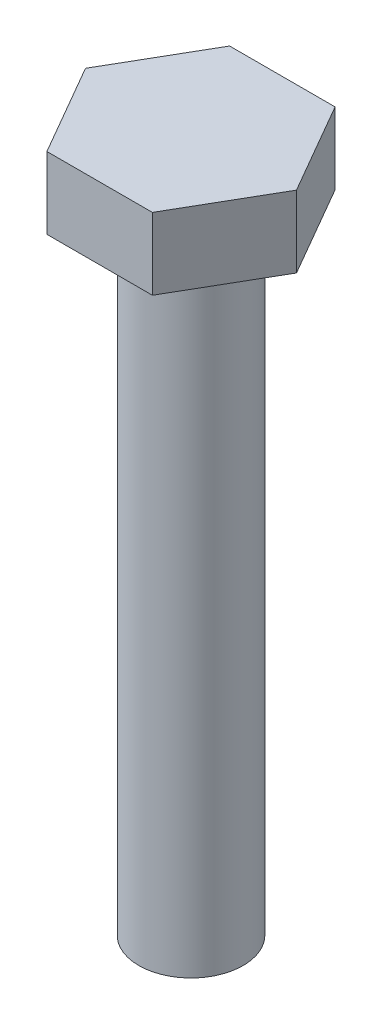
ISO-10303-21;
HEADER;
FILE_DESCRIPTION(('STEP AP214'),'2;1');
FILE_NAME('part.step','',(''),(''),'','','');
FILE_SCHEMA(('AUTOMOTIVE_DESIGN { 1 0 10303 214 1 1 1 1 }'));
ENDSEC;
DATA;
#1=APPLICATION_CONTEXT('core data for automotive mechanical design processes');
#2=APPLICATION_PROTOCOL_DEFINITION('international standard','automotive_design',2000,#1);
#3=PRODUCT_CONTEXT('',#1,'mechanical');
#4=PRODUCT('Part','Part','',(#3));
#5=PRODUCT_RELATED_PRODUCT_CATEGORY('part','',(#4));
#6=PRODUCT_DEFINITION_FORMATION('','',#4);
#7=PRODUCT_DEFINITION_CONTEXT('part definition',#1,'design');
#8=PRODUCT_DEFINITION('design','',#6,#7);
#9=PRODUCT_DEFINITION_SHAPE('','',#8);
#10=(LENGTH_UNIT() NAMED_UNIT(*) SI_UNIT(.MILLI.,.METRE.));
#11=(NAMED_UNIT(*) PLANE_ANGLE_UNIT() SI_UNIT($,.RADIAN.));
#12=(NAMED_UNIT(*) SI_UNIT($,.STERADIAN.) SOLID_ANGLE_UNIT());
#13=UNCERTAINTY_MEASURE_WITH_UNIT(LENGTH_MEASURE(1.E-05),#10,'distance_accuracy_value','');
#14=(GEOMETRIC_REPRESENTATION_CONTEXT(3) GLOBAL_UNCERTAINTY_ASSIGNED_CONTEXT((#13)) GLOBAL_UNIT_ASSIGNED_CONTEXT((#10,
#11,#12)) REPRESENTATION_CONTEXT('',''));
#15=CARTESIAN_POINT('',(0.,0.,0.));
#16=DIRECTION('',(0.,0.,1.));
#17=DIRECTION('',(1.,0.,0.));
#18=AXIS2_PLACEMENT_3D('',#15,#16,#17);
#19=CARTESIAN_POINT('',(0.,-38.1,0.));
#20=DIRECTION('',(0.,1.,0.));
#21=DIRECTION('',(0.,0.,1.));
#22=AXIS2_PLACEMENT_3D('',#19,#20,#21);
#23=CYLINDRICAL_SURFACE('',#22,3.175);
#24=CARTESIAN_POINT('',(0.,-38.1,0.));
#25=DIRECTION('',(0.,1.,0.));
#26=DIRECTION('',(0.,0.,1.));
#27=AXIS2_PLACEMENT_3D('',#24,#25,#26);
#28=CIRCLE('',#27,3.175);
#29=CARTESIAN_POINT('',(0.,-38.1,3.175));
#30=VERTEX_POINT('',#29);
#31=EDGE_CURVE('E11',#30,#30,#28,.T.);
#32=CARTESIAN_POINT('',(0.,0.,0.));
#33=DIRECTION('',(0.,1.,0.));
#34=DIRECTION('',(0.,0.,1.));
#35=AXIS2_PLACEMENT_3D('',#32,#33,#34);
#36=CIRCLE('',#35,3.175);
#37=CARTESIAN_POINT('',(0.,0.,3.175));
#38=VERTEX_POINT('',#37);
#39=EDGE_CURVE('E38',#38,#38,#36,.T.);
#40=CARTESIAN_POINT('',(0.,-38.1,3.175));
#41=CARTESIAN_POINT('',(0.,-37.703125,3.175));
#42=CARTESIAN_POINT('',(0.,-37.30625,3.175));
#43=CARTESIAN_POINT('',(0.,-36.5125,3.175));
#44=CARTESIAN_POINT('',(0.,-36.115625,3.175));
#45=CARTESIAN_POINT('',(0.,-35.321875,3.175));
#46=CARTESIAN_POINT('',(0.,-34.925,3.175));
#47=CARTESIAN_POINT('',(0.,-34.13125,3.175));
#48=CARTESIAN_POINT('',(0.,-33.734375,3.175));
#49=CARTESIAN_POINT('',(0.,-32.940625,3.175));
#50=CARTESIAN_POINT('',(0.,-32.54375,3.175));
#51=CARTESIAN_POINT('',(0.,-31.75,3.175));
#52=CARTESIAN_POINT('',(0.,-31.353125,3.175));
#53=CARTESIAN_POINT('',(0.,-30.559375,3.175));
#54=CARTESIAN_POINT('',(0.,-30.1625,3.175));
#55=CARTESIAN_POINT('',(0.,-29.36875,3.175));
#56=CARTESIAN_POINT('',(0.,-28.971875,3.175));
#57=CARTESIAN_POINT('',(0.,-28.178125,3.175));
#58=CARTESIAN_POINT('',(0.,-27.78125,3.175));
#59=CARTESIAN_POINT('',(0.,-26.9875,3.175));
#60=CARTESIAN_POINT('',(0.,-26.590625,3.175));
#61=CARTESIAN_POINT('',(0.,-25.796875,3.175));
#62=CARTESIAN_POINT('',(0.,-25.4,3.175));
#63=CARTESIAN_POINT('',(0.,-24.60625,3.175));
#64=CARTESIAN_POINT('',(0.,-24.209375,3.175));
#65=CARTESIAN_POINT('',(0.,-23.415625,3.175));
#66=CARTESIAN_POINT('',(0.,-23.01875,3.175));
#67=CARTESIAN_POINT('',(0.,-22.225,3.175));
#68=CARTESIAN_POINT('',(0.,-21.828125,3.175));
#69=CARTESIAN_POINT('',(0.,-21.034375,3.175));
#70=CARTESIAN_POINT('',(0.,-20.6375,3.175));
#71=CARTESIAN_POINT('',(0.,-19.84375,3.175));
#72=CARTESIAN_POINT('',(0.,-19.446875,3.175));
#73=CARTESIAN_POINT('',(0.,-18.653125,3.175));
#74=CARTESIAN_POINT('',(0.,-18.25625,3.175));
#75=CARTESIAN_POINT('',(0.,-17.4625,3.175));
#76=CARTESIAN_POINT('',(0.,-17.065625,3.175));
#77=CARTESIAN_POINT('',(0.,-16.271875,3.175));
#78=CARTESIAN_POINT('',(0.,-15.875,3.175));
#79=CARTESIAN_POINT('',(0.,-15.08125,3.175));
#80=CARTESIAN_POINT('',(0.,-14.684375,3.175));
#81=CARTESIAN_POINT('',(0.,-13.890625,3.175));
#82=CARTESIAN_POINT('',(0.,-13.49375,3.175));
#83=CARTESIAN_POINT('',(0.,-12.7,3.175));
#84=CARTESIAN_POINT('',(0.,-12.303125,3.175));
#85=CARTESIAN_POINT('',(0.,-11.509375,3.175));
#86=CARTESIAN_POINT('',(0.,-11.1125,3.175));
#87=CARTESIAN_POINT('',(0.,-10.31875,3.175));
#88=CARTESIAN_POINT('',(0.,-9.921875,3.175));
#89=CARTESIAN_POINT('',(0.,-9.128125,3.175));
#90=CARTESIAN_POINT('',(0.,-8.73125,3.175));
#91=CARTESIAN_POINT('',(0.,-7.9375,3.175));
#92=CARTESIAN_POINT('',(0.,-7.540625,3.175));
#93=CARTESIAN_POINT('',(0.,-6.746875,3.175));
#94=CARTESIAN_POINT('',(0.,-6.35,3.175));
#95=CARTESIAN_POINT('',(0.,-5.55625,3.175));
#96=CARTESIAN_POINT('',(0.,-5.159375,3.175));
#97=CARTESIAN_POINT('',(0.,-4.365625,3.175));
#98=CARTESIAN_POINT('',(0.,-3.96875,3.175));
#99=CARTESIAN_POINT('',(0.,-3.175,3.175));
#100=CARTESIAN_POINT('',(0.,-2.778125,3.175));
#101=CARTESIAN_POINT('',(0.,-1.984375,3.175));
#102=CARTESIAN_POINT('',(0.,-1.5875,3.175));
#103=CARTESIAN_POINT('',(0.,-0.79375,3.175));
#104=CARTESIAN_POINT('',(0.,-0.396875,3.175));
#105=CARTESIAN_POINT('',(0.,0.,3.175));
#106=B_SPLINE_CURVE_WITH_KNOTS('',3,(#40,#41,#42,#43,#44,#45,#46,#47,#48,#49,#50,#51,#52,#53,
#54,#55,#56,#57,#58,#59,#60,#61,#62,#63,#64,#65,#66,#67,#68,#69,#70,#71,#72,#73,#74,#75,#76,#77,
#78,#79,#80,#81,#82,#83,#84,#85,#86,#87,#88,#89,#90,#91,#92,#93,#94,#95,#96,#97,#98,#99,#100,
#101,#102,#103,#104,#105),.UNSPECIFIED.,.F.,.F.,(4,2,2,2,2,2,2,2,2,2,2,2,2,2,2,2,2,2,2,2,2,2,2,
2,2,2,2,2,2,2,2,2,4),(0.,1.190625,2.38125,3.571875,4.7625,5.953125,7.14375,8.334375,
9.52500000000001,10.715625,11.90625,13.096875,14.2875,15.478125,16.66875,17.859375,19.05,
20.240625,21.43125,22.621875,23.8125,25.003125,26.19375,27.384375,28.575,29.765625,30.95625,
32.146875,33.3375,34.528125,35.71875,36.909375,38.1),.UNSPECIFIED.);
#107=EDGE_CURVE('BSEAM35',#30,#38,#106,.T.);
#108=ORIENTED_EDGE('',*,*,#31,.T.);
#109=ORIENTED_EDGE('',*,*,#39,.F.);
#110=ORIENTED_EDGE('',*,*,#107,.T.);
#111=ORIENTED_EDGE('',*,*,#107,.F.);
#112=EDGE_LOOP('',(#108,#110,#109,#111));
#113=FACE_BOUND('',#112,.T.);
#114=ADVANCED_FACE('F35',(#113),#23,.T.);
#115=CARTESIAN_POINT('',(0.,-38.1,0.));
#116=DIRECTION('',(0.,1.,0.));
#117=DIRECTION('',(0.,0.,1.));
#118=AXIS2_PLACEMENT_3D('',#115,#116,#117);
#119=PLANE('',#118);
#120=ORIENTED_EDGE('',*,*,#31,.F.);
#121=EDGE_LOOP('',(#120));
#122=FACE_BOUND('',#121,.T.);
#123=ADVANCED_FACE('F146',(#122),#119,.F.);
#124=CARTESIAN_POINT('',(-3.20790243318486,4.365625,5.55625));
#125=DIRECTION('',(0.,0.,-1.));
#126=DIRECTION('',(-1.,0.,0.));
#127=AXIS2_PLACEMENT_3D('',#124,#125,#126);
#128=PLANE('',#127);
#129=DIRECTION('',(1.,0.,0.));
#130=VECTOR('',#129,1.);
#131=CARTESIAN_POINT('',(-3.20790243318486,0.,5.55625));
#132=LINE('',#131,#130);
#133=CARTESIAN_POINT('',(-3.20790243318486,0.,5.55625));
#134=VERTEX_POINT('',#133);
#135=CARTESIAN_POINT('',(3.20790243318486,0.,5.55625));
#136=VERTEX_POINT('',#135);
#137=EDGE_CURVE('E120',#134,#136,#132,.T.);
#138=ORIENTED_EDGE('',*,*,#137,.T.);
#139=DIRECTION('',(0.,-1.,0.));
#140=VECTOR('',#139,1.);
#141=CARTESIAN_POINT('',(3.20790243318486,4.365625,5.55625));
#142=LINE('',#141,#140);
#143=CARTESIAN_POINT('',(3.20790243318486,4.365625,5.55625));
#144=VERTEX_POINT('',#143);
#145=EDGE_CURVE('E137',#144,#136,#142,.T.);
#146=ORIENTED_EDGE('',*,*,#145,.F.);
#147=DIRECTION('',(1.,0.,0.));
#148=VECTOR('',#147,1.);
#149=CARTESIAN_POINT('',(-3.20790243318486,4.365625,5.55625));
#150=LINE('',#149,#148);
#151=CARTESIAN_POINT('',(-3.20790243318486,4.365625,5.55625));
#152=VERTEX_POINT('',#151);
#153=EDGE_CURVE('E130',#152,#144,#150,.T.);
#154=ORIENTED_EDGE('',*,*,#153,.F.);
#155=DIRECTION('',(0.,-1.,0.));
#156=VECTOR('',#155,1.);
#157=CARTESIAN_POINT('',(-3.20790243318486,4.365625,5.55625));
#158=LINE('',#157,#156);
#159=EDGE_CURVE('E116',#152,#134,#158,.T.);
#160=ORIENTED_EDGE('',*,*,#159,.T.);
#161=EDGE_LOOP('',(#138,#146,#154,#160));
#162=FACE_BOUND('',#161,.T.);
#163=ADVANCED_FACE('F151',(#162),#128,.F.);
#164=CARTESIAN_POINT('',(3.20790243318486,4.365625,5.55625));
#165=DIRECTION('',(-0.866025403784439,0.,-0.499999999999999));
#166=DIRECTION('',(-0.499999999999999,0.,0.866025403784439));
#167=AXIS2_PLACEMENT_3D('',#164,#165,#166);
#168=PLANE('',#167);
#169=DIRECTION('',(0.499999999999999,0.,-0.866025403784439));
#170=VECTOR('',#169,1.);
#171=CARTESIAN_POINT('',(3.20790243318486,0.,5.55625));
#172=LINE('',#171,#170);
#173=CARTESIAN_POINT('',(6.41580486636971,0.,0.));
#174=VERTEX_POINT('',#173);
#175=EDGE_CURVE('E123',#136,#174,#172,.T.);
#176=ORIENTED_EDGE('',*,*,#175,.T.);
#177=DIRECTION('',(0.,-1.,0.));
#178=VECTOR('',#177,1.);
#179=CARTESIAN_POINT('',(6.41580486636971,4.365625,0.));
#180=LINE('',#179,#178);
#181=CARTESIAN_POINT('',(6.41580486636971,4.365625,0.));
#182=VERTEX_POINT('',#181);
#183=EDGE_CURVE('E134',#182,#174,#180,.T.);
#184=ORIENTED_EDGE('',*,*,#183,.F.);
#185=DIRECTION('',(0.499999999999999,0.,-0.866025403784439));
#186=VECTOR('',#185,1.);
#187=CARTESIAN_POINT('',(3.20790243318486,4.365625,5.55625));
#188=LINE('',#187,#186);
#189=EDGE_CURVE('E89',#144,#182,#188,.T.);
#190=ORIENTED_EDGE('',*,*,#189,.F.);
#191=ORIENTED_EDGE('',*,*,#145,.T.);
#192=EDGE_LOOP('',(#176,#184,#190,#191));
#193=FACE_BOUND('',#192,.T.);
#194=ADVANCED_FACE('F157',(#193),#168,.F.);
#195=CARTESIAN_POINT('',(6.41580486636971,4.365625,0.));
#196=DIRECTION('',(-0.866025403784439,0.,0.5));
#197=DIRECTION('',(0.5,0.,0.866025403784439));
#198=AXIS2_PLACEMENT_3D('',#195,#196,#197);
#199=PLANE('',#198);
#200=DIRECTION('',(-0.5,0.,-0.866025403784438));
#201=VECTOR('',#200,1.);
#202=CARTESIAN_POINT('',(6.41580486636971,0.,0.));
#203=LINE('',#202,#201);
#204=CARTESIAN_POINT('',(3.20790243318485,0.,-5.55625000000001));
#205=VERTEX_POINT('',#204);
#206=EDGE_CURVE('E125',#174,#205,#203,.T.);
#207=ORIENTED_EDGE('',*,*,#206,.T.);
#208=DIRECTION('',(0.,-1.,0.));
#209=VECTOR('',#208,1.);
#210=CARTESIAN_POINT('',(3.20790243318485,4.365625,-5.55625000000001));
#211=LINE('',#210,#209);
#212=CARTESIAN_POINT('',(3.20790243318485,4.365625,-5.55625000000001));
#213=VERTEX_POINT('',#212);
#214=EDGE_CURVE('E111',#213,#205,#211,.T.);
#215=ORIENTED_EDGE('',*,*,#214,.F.);
#216=DIRECTION('',(-0.5,0.,-0.866025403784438));
#217=VECTOR('',#216,1.);
#218=CARTESIAN_POINT('',(6.41580486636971,4.365625,0.));
#219=LINE('',#218,#217);
#220=EDGE_CURVE('E102',#182,#213,#219,.T.);
#221=ORIENTED_EDGE('',*,*,#220,.F.);
#222=ORIENTED_EDGE('',*,*,#183,.T.);
#223=EDGE_LOOP('',(#207,#215,#221,#222));
#224=FACE_BOUND('',#223,.T.);
#225=ADVANCED_FACE('F163',(#224),#199,.F.);
#226=CARTESIAN_POINT('',(3.20790243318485,4.365625,-5.55625000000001));
#227=DIRECTION('',(0.,0.,1.));
#228=DIRECTION('',(1.,0.,0.));
#229=AXIS2_PLACEMENT_3D('',#226,#227,#228);
#230=PLANE('',#229);
#231=DIRECTION('',(-1.,0.,0.));
#232=VECTOR('',#231,1.);
#233=CARTESIAN_POINT('',(3.20790243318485,0.,-5.55625000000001));
#234=LINE('',#233,#232);
#235=CARTESIAN_POINT('',(-3.20790243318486,0.,-5.55625000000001));
#236=VERTEX_POINT('',#235);
#237=EDGE_CURVE('E110',#205,#236,#234,.T.);
#238=ORIENTED_EDGE('',*,*,#237,.T.);
#239=DIRECTION('',(0.,-1.,0.));
#240=VECTOR('',#239,1.);
#241=CARTESIAN_POINT('',(-3.20790243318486,4.365625,-5.55625000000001));
#242=LINE('',#241,#240);
#243=CARTESIAN_POINT('',(-3.20790243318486,4.365625,-5.55625000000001));
#244=VERTEX_POINT('',#243);
#245=EDGE_CURVE('E107',#244,#236,#242,.T.);
#246=ORIENTED_EDGE('',*,*,#245,.F.);
#247=DIRECTION('',(-1.,0.,0.));
#248=VECTOR('',#247,1.);
#249=CARTESIAN_POINT('',(3.20790243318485,4.365625,-5.55625000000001));
#250=LINE('',#249,#248);
#251=EDGE_CURVE('E96',#213,#244,#250,.T.);
#252=ORIENTED_EDGE('',*,*,#251,.F.);
#253=ORIENTED_EDGE('',*,*,#214,.T.);
#254=EDGE_LOOP('',(#238,#246,#252,#253));
#255=FACE_BOUND('',#254,.T.);
#256=ADVANCED_FACE('F108',(#255),#230,.F.);
#257=CARTESIAN_POINT('',(-3.20790243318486,4.365625,-5.55625000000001));
#258=DIRECTION('',(0.866025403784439,0.,0.5));
#259=DIRECTION('',(0.5,0.,-0.866025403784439));
#260=AXIS2_PLACEMENT_3D('',#257,#258,#259);
#261=PLANE('',#260);
#262=DIRECTION('',(-0.5,0.,0.866025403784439));
#263=VECTOR('',#262,1.);
#264=CARTESIAN_POINT('',(-3.20790243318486,0.,-5.55625000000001));
#265=LINE('',#264,#263);
#266=CARTESIAN_POINT('',(-6.41580486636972,0.,0.));
#267=VERTEX_POINT('',#266);
#268=EDGE_CURVE('E74',#236,#267,#265,.T.);
#269=ORIENTED_EDGE('',*,*,#268,.T.);
#270=DIRECTION('',(0.,-1.,0.));
#271=VECTOR('',#270,1.);
#272=CARTESIAN_POINT('',(-6.41580486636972,4.365625,0.));
#273=LINE('',#272,#271);
#274=CARTESIAN_POINT('',(-6.41580486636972,4.365625,0.));
#275=VERTEX_POINT('',#274);
#276=EDGE_CURVE('E112',#275,#267,#273,.T.);
#277=ORIENTED_EDGE('',*,*,#276,.F.);
#278=DIRECTION('',(-0.5,0.,0.866025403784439));
#279=VECTOR('',#278,1.);
#280=CARTESIAN_POINT('',(-3.20790243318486,4.365625,-5.55625000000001));
#281=LINE('',#280,#279);
#282=EDGE_CURVE('E100',#244,#275,#281,.T.);
#283=ORIENTED_EDGE('',*,*,#282,.F.);
#284=ORIENTED_EDGE('',*,*,#245,.T.);
#285=EDGE_LOOP('',(#269,#277,#283,#284));
#286=FACE_BOUND('',#285,.T.);
#287=ADVANCED_FACE('F114',(#286),#261,.F.);
#288=CARTESIAN_POINT('',(-6.41580486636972,4.365625,0.));
#289=DIRECTION('',(0.866025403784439,0.,-0.5));
#290=DIRECTION('',(-0.5,0.,-0.866025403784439));
#291=AXIS2_PLACEMENT_3D('',#288,#289,#290);
#292=PLANE('',#291);
#293=DIRECTION('',(0.5,0.,0.866025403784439));
#294=VECTOR('',#293,1.);
#295=CARTESIAN_POINT('',(-6.41580486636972,0.,0.));
#296=LINE('',#295,#294);
#297=EDGE_CURVE('E80',#267,#134,#296,.T.);
#298=ORIENTED_EDGE('',*,*,#297,.T.);
#299=ORIENTED_EDGE('',*,*,#159,.F.);
#300=DIRECTION('',(0.5,0.,0.866025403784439));
#301=VECTOR('',#300,1.);
#302=CARTESIAN_POINT('',(-6.41580486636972,4.365625,0.));
#303=LINE('',#302,#301);
#304=EDGE_CURVE('E51',#275,#152,#303,.T.);
#305=ORIENTED_EDGE('',*,*,#304,.F.);
#306=ORIENTED_EDGE('',*,*,#276,.T.);
#307=EDGE_LOOP('',(#298,#299,#305,#306));
#308=FACE_BOUND('',#307,.T.);
#309=ADVANCED_FACE('F171',(#308),#292,.F.);
#310=CARTESIAN_POINT('',(0.,4.365625,0.));
#311=DIRECTION('',(0.,1.,0.));
#312=DIRECTION('',(0.,0.,1.));
#313=AXIS2_PLACEMENT_3D('',#310,#311,#312);
#314=PLANE('',#313);
#315=ORIENTED_EDGE('',*,*,#153,.T.);
#316=ORIENTED_EDGE('',*,*,#189,.T.);
#317=ORIENTED_EDGE('',*,*,#220,.T.);
#318=ORIENTED_EDGE('',*,*,#251,.T.);
#319=ORIENTED_EDGE('',*,*,#282,.T.);
#320=ORIENTED_EDGE('',*,*,#304,.T.);
#321=EDGE_LOOP('',(#315,#316,#317,#318,#319,#320));
#322=FACE_BOUND('',#321,.T.);
#323=ADVANCED_FACE('F98',(#322),#314,.T.);
#324=CARTESIAN_POINT('',(0.,0.,0.));
#325=DIRECTION('',(0.,1.,0.));
#326=DIRECTION('',(0.,0.,1.));
#327=AXIS2_PLACEMENT_3D('',#324,#325,#326);
#328=PLANE('',#327);
#329=ORIENTED_EDGE('',*,*,#39,.T.);
#330=EDGE_LOOP('',(#329));
#331=FACE_BOUND('',#330,.T.);
#332=ORIENTED_EDGE('',*,*,#137,.F.);
#333=ORIENTED_EDGE('',*,*,#297,.F.);
#334=ORIENTED_EDGE('',*,*,#268,.F.);
#335=ORIENTED_EDGE('',*,*,#237,.F.);
#336=ORIENTED_EDGE('',*,*,#206,.F.);
#337=ORIENTED_EDGE('',*,*,#175,.F.);
#338=EDGE_LOOP('',(#332,#333,#334,#335,#336,#337));
#339=FACE_BOUND('',#338,.T.);
#340=ADVANCED_FACE('F142',(#331,#339),#328,.F.);
#341=CLOSED_SHELL('',(#114,#123,#163,#194,#225,#256,#287,#309,#323,#340));
#342=MANIFOLD_SOLID_BREP('B2',#341);
#343=ADVANCED_BREP_SHAPE_REPRESENTATION('',(#18,#342),#14);
#344=SHAPE_DEFINITION_REPRESENTATION(#9,#343);
ENDSEC;
END-ISO-10303-21;
